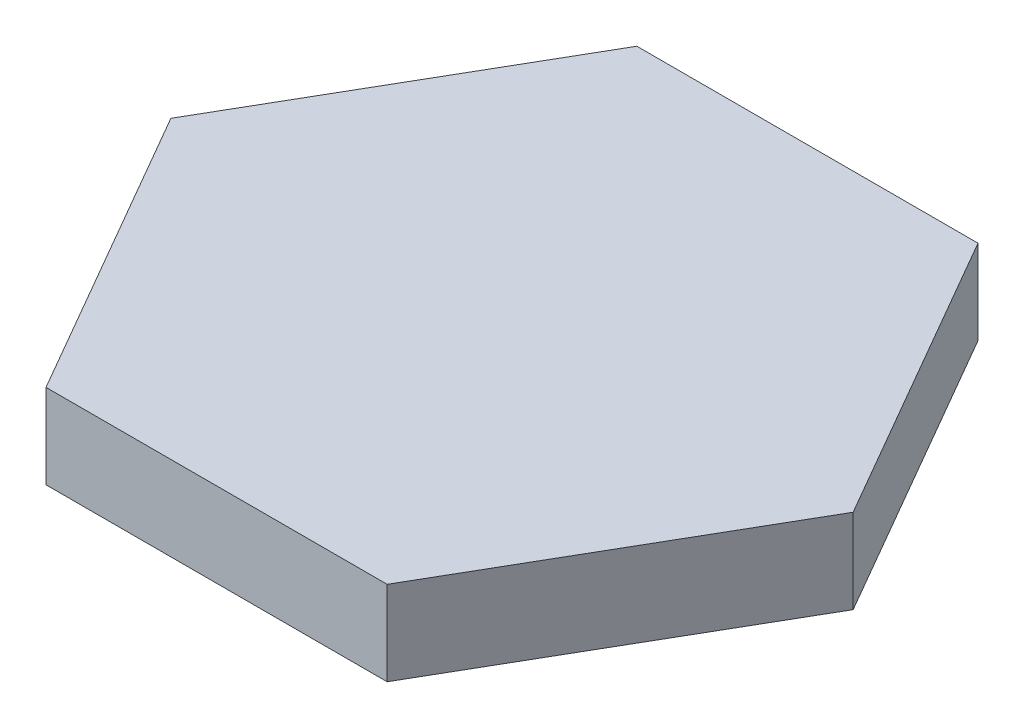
from build123d import *

# Parameters (mm, degrees)
BOSS_EXTRUDE1_DEPTH = 10


with BuildPart() as part:
    # Sketch1 → Boss-Extrude1 (new body)
    with BuildSketch(Plane(origin=(0, 0, 0), x_dir=(1, 0, 0), z_dir=(0, 1, 0))):
        Polygon((20.207259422, -35), (40.414518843, 0), (20.207259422, 35), (-20.207259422, 35), (-40.414518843, 0), (-20.207259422, -35), align=None)
    extrude(amount=BOSS_EXTRUDE1_DEPTH)


solid = part.part
